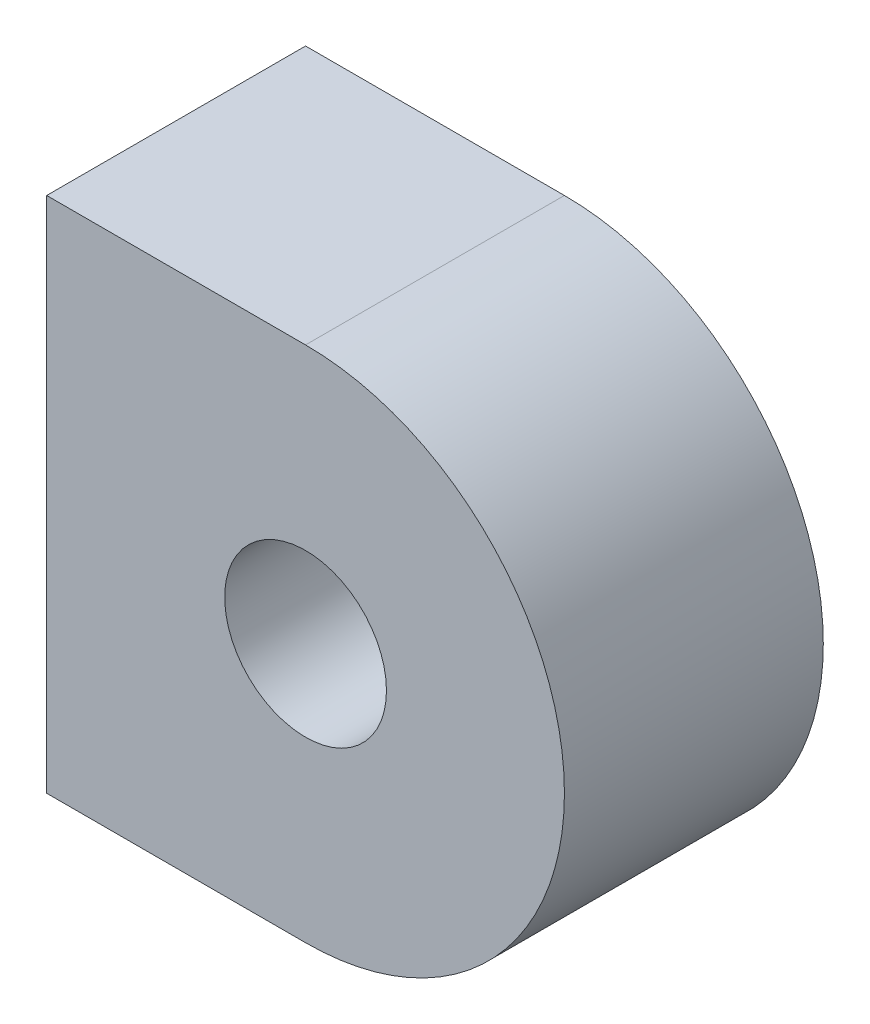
ISO-10303-21;
HEADER;
FILE_DESCRIPTION(('STEP AP214'),'2;1');
FILE_NAME('part.step','',(''),(''),'','','');
FILE_SCHEMA(('AUTOMOTIVE_DESIGN { 1 0 10303 214 1 1 1 1 }'));
ENDSEC;
DATA;
#1=APPLICATION_CONTEXT('core data for automotive mechanical design processes');
#2=APPLICATION_PROTOCOL_DEFINITION('international standard','automotive_design',2000,#1);
#3=PRODUCT_CONTEXT('',#1,'mechanical');
#4=PRODUCT('Part','Part','',(#3));
#5=PRODUCT_RELATED_PRODUCT_CATEGORY('part','',(#4));
#6=PRODUCT_DEFINITION_FORMATION('','',#4);
#7=PRODUCT_DEFINITION_CONTEXT('part definition',#1,'design');
#8=PRODUCT_DEFINITION('design','',#6,#7);
#9=PRODUCT_DEFINITION_SHAPE('','',#8);
#10=(LENGTH_UNIT() NAMED_UNIT(*) SI_UNIT(.MILLI.,.METRE.));
#11=(NAMED_UNIT(*) PLANE_ANGLE_UNIT() SI_UNIT($,.RADIAN.));
#12=(NAMED_UNIT(*) SI_UNIT($,.STERADIAN.) SOLID_ANGLE_UNIT());
#13=UNCERTAINTY_MEASURE_WITH_UNIT(LENGTH_MEASURE(1.E-05),#10,'distance_accuracy_value','');
#14=(GEOMETRIC_REPRESENTATION_CONTEXT(3) GLOBAL_UNCERTAINTY_ASSIGNED_CONTEXT((#13)) GLOBAL_UNIT_ASSIGNED_CONTEXT((#10,
#11,#12)) REPRESENTATION_CONTEXT('',''));
#15=CARTESIAN_POINT('',(0.,0.,0.));
#16=DIRECTION('',(0.,0.,1.));
#17=DIRECTION('',(1.,0.,0.));
#18=AXIS2_PLACEMENT_3D('',#15,#16,#17);
#19=CARTESIAN_POINT('',(0.,0.,20.));
#20=DIRECTION('',(1.,0.,0.));
#21=DIRECTION('',(0.,1.,0.));
#22=AXIS2_PLACEMENT_3D('',#19,#20,#21);
#23=PLANE('',#22);
#24=DIRECTION('',(0.,-1.,0.));
#25=VECTOR('',#24,1.);
#26=CARTESIAN_POINT('',(0.,0.,0.));
#27=LINE('',#26,#25);
#28=CARTESIAN_POINT('',(0.,40.,0.));
#29=VERTEX_POINT('',#28);
#30=CARTESIAN_POINT('',(0.,0.,0.));
#31=VERTEX_POINT('',#30);
#32=EDGE_CURVE('E71',#29,#31,#27,.T.);
#33=ORIENTED_EDGE('',*,*,#32,.T.);
#34=DIRECTION('',(0.,0.,-1.));
#35=VECTOR('',#34,1.);
#36=CARTESIAN_POINT('',(0.,0.,20.));
#37=LINE('',#36,#35);
#38=CARTESIAN_POINT('',(0.,0.,20.));
#39=VERTEX_POINT('',#38);
#40=EDGE_CURVE('E11',#39,#31,#37,.T.);
#41=ORIENTED_EDGE('',*,*,#40,.F.);
#42=DIRECTION('',(0.,-1.,0.));
#43=VECTOR('',#42,1.);
#44=CARTESIAN_POINT('',(0.,0.,20.));
#45=LINE('',#44,#43);
#46=CARTESIAN_POINT('',(0.,40.,20.));
#47=VERTEX_POINT('',#46);
#48=EDGE_CURVE('E92',#47,#39,#45,.T.);
#49=ORIENTED_EDGE('',*,*,#48,.F.);
#50=DIRECTION('',(0.,0.,-1.));
#51=VECTOR('',#50,1.);
#52=CARTESIAN_POINT('',(0.,40.,20.));
#53=LINE('',#52,#51);
#54=EDGE_CURVE('E83',#47,#29,#53,.T.);
#55=ORIENTED_EDGE('',*,*,#54,.T.);
#56=EDGE_LOOP('',(#33,#41,#49,#55));
#57=FACE_BOUND('',#56,.T.);
#58=ADVANCED_FACE('F26',(#57),#23,.F.);
#59=CARTESIAN_POINT('',(0.,0.,20.));
#60=DIRECTION('',(0.,1.,0.));
#61=DIRECTION('',(-1.,0.,0.));
#62=AXIS2_PLACEMENT_3D('',#59,#60,#61);
#63=PLANE('',#62);
#64=DIRECTION('',(1.,0.,0.));
#65=VECTOR('',#64,1.);
#66=CARTESIAN_POINT('',(0.,0.,0.));
#67=LINE('',#66,#65);
#68=CARTESIAN_POINT('',(20.,0.,0.));
#69=VERTEX_POINT('',#68);
#70=EDGE_CURVE('E67',#31,#69,#67,.T.);
#71=ORIENTED_EDGE('',*,*,#70,.T.);
#72=DIRECTION('',(0.,0.,-1.));
#73=VECTOR('',#72,1.);
#74=CARTESIAN_POINT('',(20.,0.,20.));
#75=LINE('',#74,#73);
#76=CARTESIAN_POINT('',(20.,0.,20.));
#77=VERTEX_POINT('',#76);
#78=EDGE_CURVE('E34',#77,#69,#75,.T.);
#79=ORIENTED_EDGE('',*,*,#78,.F.);
#80=DIRECTION('',(1.,0.,0.));
#81=VECTOR('',#80,1.);
#82=CARTESIAN_POINT('',(0.,0.,20.));
#83=LINE('',#82,#81);
#84=EDGE_CURVE('E79',#39,#77,#83,.T.);
#85=ORIENTED_EDGE('',*,*,#84,.F.);
#86=ORIENTED_EDGE('',*,*,#40,.T.);
#87=EDGE_LOOP('',(#71,#79,#85,#86));
#88=FACE_BOUND('',#87,.T.);
#89=ADVANCED_FACE('F78',(#88),#63,.F.);
#90=CARTESIAN_POINT('',(20.,20.,20.));
#91=DIRECTION('',(0.,0.,-1.));
#92=DIRECTION('',(-1.,0.,0.));
#93=AXIS2_PLACEMENT_3D('',#90,#91,#92);
#94=CYLINDRICAL_SURFACE('',#93,20.);
#95=CARTESIAN_POINT('',(20.,20.,0.));
#96=DIRECTION('',(0.,0.,1.));
#97=DIRECTION('',(-1.,0.,0.));
#98=AXIS2_PLACEMENT_3D('',#95,#96,#97);
#99=CIRCLE('',#98,20.);
#100=CARTESIAN_POINT('',(20.,40.,0.));
#101=VERTEX_POINT('',#100);
#102=EDGE_CURVE('E72',#69,#101,#99,.T.);
#103=ORIENTED_EDGE('',*,*,#102,.T.);
#104=DIRECTION('',(0.,0.,-1.));
#105=VECTOR('',#104,1.);
#106=CARTESIAN_POINT('',(20.,40.,20.));
#107=LINE('',#106,#105);
#108=CARTESIAN_POINT('',(20.,40.,20.));
#109=VERTEX_POINT('',#108);
#110=EDGE_CURVE('E98',#109,#101,#107,.T.);
#111=ORIENTED_EDGE('',*,*,#110,.F.);
#112=CARTESIAN_POINT('',(20.,20.,20.));
#113=DIRECTION('',(0.,0.,1.));
#114=DIRECTION('',(-1.,0.,0.));
#115=AXIS2_PLACEMENT_3D('',#112,#113,#114);
#116=CIRCLE('',#115,20.);
#117=EDGE_CURVE('E46',#77,#109,#116,.T.);
#118=ORIENTED_EDGE('',*,*,#117,.F.);
#119=ORIENTED_EDGE('',*,*,#78,.T.);
#120=EDGE_LOOP('',(#103,#111,#118,#119));
#121=FACE_BOUND('',#120,.T.);
#122=ADVANCED_FACE('F102',(#121),#94,.T.);
#123=CARTESIAN_POINT('',(0.,40.,20.));
#124=DIRECTION('',(0.,-1.,0.));
#125=DIRECTION('',(1.,0.,0.));
#126=AXIS2_PLACEMENT_3D('',#123,#124,#125);
#127=PLANE('',#126);
#128=DIRECTION('',(-1.,0.,0.));
#129=VECTOR('',#128,1.);
#130=CARTESIAN_POINT('',(0.,40.,0.));
#131=LINE('',#130,#129);
#132=EDGE_CURVE('E90',#101,#29,#131,.T.);
#133=ORIENTED_EDGE('',*,*,#132,.T.);
#134=ORIENTED_EDGE('',*,*,#54,.F.);
#135=DIRECTION('',(-1.,0.,0.));
#136=VECTOR('',#135,1.);
#137=CARTESIAN_POINT('',(0.,40.,20.));
#138=LINE('',#137,#136);
#139=EDGE_CURVE('E41',#109,#47,#138,.T.);
#140=ORIENTED_EDGE('',*,*,#139,.F.);
#141=ORIENTED_EDGE('',*,*,#110,.T.);
#142=EDGE_LOOP('',(#133,#134,#140,#141));
#143=FACE_BOUND('',#142,.T.);
#144=ADVANCED_FACE('F104',(#143),#127,.F.);
#145=CARTESIAN_POINT('',(20.,20.,20.));
#146=DIRECTION('',(0.,0.,-1.));
#147=DIRECTION('',(-1.,0.,0.));
#148=AXIS2_PLACEMENT_3D('',#145,#146,#147);
#149=PLANE('',#148);
#150=CARTESIAN_POINT('',(20.,20.,20.));
#151=DIRECTION('',(0.,0.,1.));
#152=DIRECTION('',(1.,0.,0.));
#153=AXIS2_PLACEMENT_3D('',#150,#151,#152);
#154=CIRCLE('',#153,6.25);
#155=CARTESIAN_POINT('',(26.25,20.,20.));
#156=VERTEX_POINT('',#155);
#157=EDGE_CURVE('E86',#156,#156,#154,.T.);
#158=ORIENTED_EDGE('',*,*,#157,.F.);
#159=EDGE_LOOP('',(#158));
#160=FACE_BOUND('',#159,.T.);
#161=ORIENTED_EDGE('',*,*,#48,.T.);
#162=ORIENTED_EDGE('',*,*,#84,.T.);
#163=ORIENTED_EDGE('',*,*,#117,.T.);
#164=ORIENTED_EDGE('',*,*,#139,.T.);
#165=EDGE_LOOP('',(#161,#162,#163,#164));
#166=FACE_BOUND('',#165,.T.);
#167=ADVANCED_FACE('F105',(#160,#166),#149,.F.);
#168=CARTESIAN_POINT('',(20.,20.,0.));
#169=DIRECTION('',(0.,0.,-1.));
#170=DIRECTION('',(-1.,0.,0.));
#171=AXIS2_PLACEMENT_3D('',#168,#169,#170);
#172=PLANE('',#171);
#173=CARTESIAN_POINT('',(20.,20.,0.));
#174=DIRECTION('',(0.,0.,-1.));
#175=DIRECTION('',(-1.,0.,0.));
#176=AXIS2_PLACEMENT_3D('',#173,#174,#175);
#177=CIRCLE('',#176,6.25);
#178=CARTESIAN_POINT('',(13.75,20.,0.));
#179=VERTEX_POINT('',#178);
#180=EDGE_CURVE('E29',#179,#179,#177,.T.);
#181=ORIENTED_EDGE('',*,*,#180,.F.);
#182=EDGE_LOOP('',(#181));
#183=FACE_BOUND('',#182,.T.);
#184=ORIENTED_EDGE('',*,*,#32,.F.);
#185=ORIENTED_EDGE('',*,*,#132,.F.);
#186=ORIENTED_EDGE('',*,*,#102,.F.);
#187=ORIENTED_EDGE('',*,*,#70,.F.);
#188=EDGE_LOOP('',(#184,#185,#186,#187));
#189=FACE_BOUND('',#188,.T.);
#190=ADVANCED_FACE('F68',(#183,#189),#172,.T.);
#191=CARTESIAN_POINT('',(20.,20.,20.));
#192=DIRECTION('',(0.,0.,1.));
#193=DIRECTION('',(1.,0.,0.));
#194=AXIS2_PLACEMENT_3D('',#191,#192,#193);
#195=CYLINDRICAL_SURFACE('',#194,6.25);
#196=ORIENTED_EDGE('',*,*,#180,.T.);
#197=EDGE_LOOP('',(#196));
#198=FACE_BOUND('',#197,.T.);
#199=ORIENTED_EDGE('',*,*,#157,.T.);
#200=EDGE_LOOP('',(#199));
#201=FACE_BOUND('',#200,.T.);
#202=ADVANCED_FACE('F113',(#198,#201),#195,.F.);
#203=CLOSED_SHELL('',(#58,#89,#122,#144,#167,#190,#202));
#204=MANIFOLD_SOLID_BREP('B2',#203);
#205=ADVANCED_BREP_SHAPE_REPRESENTATION('',(#18,#204),#14);
#206=SHAPE_DEFINITION_REPRESENTATION(#9,#205);
ENDSEC;
END-ISO-10303-21;
